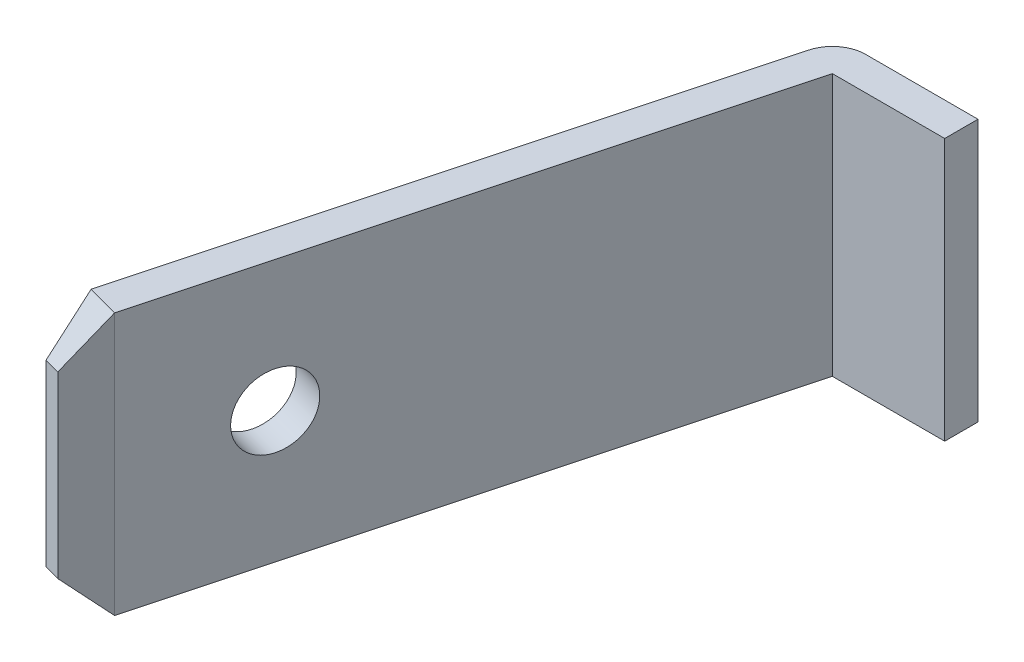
ISO-10303-21;
HEADER;
FILE_DESCRIPTION(('STEP AP214'),'2;1');
FILE_NAME('part.step','',(''),(''),'','','');
FILE_SCHEMA(('AUTOMOTIVE_DESIGN { 1 0 10303 214 1 1 1 1 }'));
ENDSEC;
DATA;
#1=APPLICATION_CONTEXT('core data for automotive mechanical design processes');
#2=APPLICATION_PROTOCOL_DEFINITION('international standard','automotive_design',2000,#1);
#3=PRODUCT_CONTEXT('',#1,'mechanical');
#4=PRODUCT('Part','Part','',(#3));
#5=PRODUCT_RELATED_PRODUCT_CATEGORY('part','',(#4));
#6=PRODUCT_DEFINITION_FORMATION('','',#4);
#7=PRODUCT_DEFINITION_CONTEXT('part definition',#1,'design');
#8=PRODUCT_DEFINITION('design','',#6,#7);
#9=PRODUCT_DEFINITION_SHAPE('','',#8);
#10=(LENGTH_UNIT() NAMED_UNIT(*) SI_UNIT(.MILLI.,.METRE.));
#11=(NAMED_UNIT(*) PLANE_ANGLE_UNIT() SI_UNIT($,.RADIAN.));
#12=(NAMED_UNIT(*) SI_UNIT($,.STERADIAN.) SOLID_ANGLE_UNIT());
#13=UNCERTAINTY_MEASURE_WITH_UNIT(LENGTH_MEASURE(1.E-05),#10,'distance_accuracy_value','');
#14=(GEOMETRIC_REPRESENTATION_CONTEXT(3) GLOBAL_UNCERTAINTY_ASSIGNED_CONTEXT((#13)) GLOBAL_UNIT_ASSIGNED_CONTEXT((#10,
#11,#12)) REPRESENTATION_CONTEXT('',''));
#15=CARTESIAN_POINT('',(0.,0.,0.));
#16=DIRECTION('',(0.,0.,1.));
#17=DIRECTION('',(1.,0.,0.));
#18=AXIS2_PLACEMENT_3D('',#15,#16,#17);
#19=CARTESIAN_POINT('',(-13.1,5.062,-14.));
#20=DIRECTION('',(1.,0.,0.));
#21=DIRECTION('',(0.,0.,-1.));
#22=AXIS2_PLACEMENT_3D('',#19,#20,#21);
#23=PLANE('',#22);
#24=DIRECTION('',(0.,1.,0.));
#25=VECTOR('',#24,1.);
#26=CARTESIAN_POINT('',(-13.1,5.062,-14.));
#27=LINE('',#26,#25);
#28=CARTESIAN_POINT('',(-13.1,1.912,-14.));
#29=VERTEX_POINT('',#28);
#30=CARTESIAN_POINT('',(-13.1,8.212,-14.));
#31=VERTEX_POINT('',#30);
#32=EDGE_CURVE('E129',#29,#31,#27,.T.);
#33=ORIENTED_EDGE('',*,*,#32,.F.);
#34=DIRECTION('',(0.,0.,-1.));
#35=VECTOR('',#34,1.);
#36=CARTESIAN_POINT('',(-13.1,1.912,-14.));
#37=LINE('',#36,#35);
#38=CARTESIAN_POINT('',(-13.1,1.912,-14.8));
#39=VERTEX_POINT('',#38);
#40=EDGE_CURVE('E166',#29,#39,#37,.T.);
#41=ORIENTED_EDGE('',*,*,#40,.T.);
#42=DIRECTION('',(0.,1.,0.));
#43=VECTOR('',#42,1.);
#44=CARTESIAN_POINT('',(-13.1,5.062,-14.8));
#45=LINE('',#44,#43);
#46=CARTESIAN_POINT('',(-13.1,8.212,-14.8));
#47=VERTEX_POINT('',#46);
#48=EDGE_CURVE('E127',#39,#47,#45,.T.);
#49=ORIENTED_EDGE('',*,*,#48,.T.);
#50=DIRECTION('',(0.,0.,-1.));
#51=VECTOR('',#50,1.);
#52=CARTESIAN_POINT('',(-13.1,8.212,-14.));
#53=LINE('',#52,#51);
#54=EDGE_CURVE('E92',#47,#31,#53,.F.);
#55=ORIENTED_EDGE('',*,*,#54,.T.);
#56=EDGE_LOOP('',(#33,#41,#49,#55));
#57=FACE_BOUND('',#56,.T.);
#58=ADVANCED_FACE('F18',(#57),#23,.T.);
#59=CARTESIAN_POINT('',(-19.8961763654,0.651999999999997,0.514397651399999));
#60=DIRECTION('',(-0.896409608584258,0.,-0.443226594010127));
#61=DIRECTION('',(-0.443226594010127,0.,0.896409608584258));
#62=AXIS2_PLACEMENT_3D('',#59,#60,#61);
#63=PLANE('',#62);
#64=DIRECTION('',(0.,1.,0.));
#65=VECTOR('',#64,1.);
#66=CARTESIAN_POINT('',(-19.4441721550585,5.062,-0.399764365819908));
#67=LINE('',#66,#65);
#68=CARTESIAN_POINT('',(-19.444172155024,1.91200000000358,-0.399764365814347));
#69=VERTEX_POINT('',#68);
#70=CARTESIAN_POINT('',(-19.4441721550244,8.21199999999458,-0.399764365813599));
#71=VERTEX_POINT('',#70);
#72=EDGE_CURVE('E126',#69,#71,#67,.T.);
#73=ORIENTED_EDGE('',*,*,#72,.T.);
#74=DIRECTION('',(0.316466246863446,0.700140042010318,-0.640041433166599));
#75=VECTOR('',#74,1.);
#76=CARTESIAN_POINT('',(-19.8961763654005,7.21200000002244,0.514397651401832));
#77=LINE('',#76,#75);
#78=CARTESIAN_POINT('',(-19.8961763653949,7.21200000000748,0.514397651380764));
#79=VERTEX_POINT('',#78);
#80=EDGE_CURVE('E162',#79,#71,#77,.T.);
#81=ORIENTED_EDGE('',*,*,#80,.F.);
#82=DIRECTION('',(0.,1.,0.));
#83=VECTOR('',#82,1.);
#84=CARTESIAN_POINT('',(-19.896176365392,5.062,0.514397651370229));
#85=LINE('',#84,#83);
#86=CARTESIAN_POINT('',(-19.8961763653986,2.91199999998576,0.514397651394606));
#87=VERTEX_POINT('',#86);
#88=EDGE_CURVE('E149',#79,#87,#85,.F.);
#89=ORIENTED_EDGE('',*,*,#88,.T.);
#90=DIRECTION('',(0.316466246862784,-0.700140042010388,-0.64004143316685));
#91=VECTOR('',#90,1.);
#92=CARTESIAN_POINT('',(-19.8961763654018,2.9119999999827,0.514397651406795));
#93=LINE('',#92,#91);
#94=EDGE_CURVE('E132',#87,#69,#93,.T.);
#95=ORIENTED_EDGE('',*,*,#94,.T.);
#96=EDGE_LOOP('',(#73,#81,#89,#95));
#97=FACE_BOUND('',#96,.T.);
#98=ADVANCED_FACE('F234',(#97),#63,.F.);
#99=CARTESIAN_POINT('',(-11.62485362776,8.212,1.6954157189));
#100=DIRECTION('',(-0.183012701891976,0.707106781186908,0.683012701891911));
#101=DIRECTION('',(0.,-0.69474659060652,0.719254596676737));
#102=AXIS2_PLACEMENT_3D('',#99,#100,#101);
#103=PLANE('',#102);
#104=DIRECTION('',(-0.965925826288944,0.,-0.258819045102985));
#105=VECTOR('',#104,1.);
#106=CARTESIAN_POINT('',(-19.7029912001,7.212,0.5661614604));
#107=LINE('',#106,#105);
#108=CARTESIAN_POINT('',(-20.2825466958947,7.212,0.410870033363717));
#109=VERTEX_POINT('',#108);
#110=EDGE_CURVE('E159',#109,#79,#107,.F.);
#111=ORIENTED_EDGE('',*,*,#110,.T.);
#112=ORIENTED_EDGE('',*,*,#80,.T.);
#113=DIRECTION('',(0.965925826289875,0.,0.258819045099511));
#114=VECTOR('',#113,1.);
#115=CARTESIAN_POINT('',(-20.2169128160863,8.212,-0.606819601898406));
#116=LINE('',#115,#114);
#117=CARTESIAN_POINT('',(-20.2169128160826,8.21200000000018,-0.606819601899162));
#118=VERTEX_POINT('',#117);
#119=EDGE_CURVE('E110',#118,#71,#116,.T.);
#120=ORIENTED_EDGE('',*,*,#119,.F.);
#121=DIRECTION('',(-0.0459529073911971,-0.700140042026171,0.71252526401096));
#122=VECTOR('',#121,1.);
#123=CARTESIAN_POINT('',(-20.2169128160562,8.21199999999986,-0.606819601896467));
#124=LINE('',#123,#122);
#125=EDGE_CURVE('E156',#118,#109,#124,.T.);
#126=ORIENTED_EDGE('',*,*,#125,.T.);
#127=EDGE_LOOP('',(#111,#112,#120,#126));
#128=FACE_BOUND('',#127,.T.);
#129=ADVANCED_FACE('F231',(#128),#103,.T.);
#130=CARTESIAN_POINT('',(-19.7029912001,5.062,0.5661614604));
#131=DIRECTION('',(0.258819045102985,0.,-0.965925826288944));
#132=DIRECTION('',(-0.965925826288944,0.,-0.258819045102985));
#133=AXIS2_PLACEMENT_3D('',#130,#131,#132);
#134=PLANE('',#133);
#135=ORIENTED_EDGE('',*,*,#88,.F.);
#136=ORIENTED_EDGE('',*,*,#110,.F.);
#137=DIRECTION('',(0.,1.,0.));
#138=VECTOR('',#137,1.);
#139=CARTESIAN_POINT('',(-20.2825466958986,9.472,0.410870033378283));
#140=LINE('',#139,#138);
#141=CARTESIAN_POINT('',(-20.2825466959,2.91199999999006,0.41087003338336));
#142=VERTEX_POINT('',#141);
#143=EDGE_CURVE('E152',#109,#142,#140,.F.);
#144=ORIENTED_EDGE('',*,*,#143,.T.);
#145=DIRECTION('',(0.965925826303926,-5.71873277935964E-11,0.25881904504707));
#146=VECTOR('',#145,1.);
#147=CARTESIAN_POINT('',(-20.2825466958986,2.91200000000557,0.410870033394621));
#148=LINE('',#147,#146);
#149=EDGE_CURVE('E135',#142,#87,#148,.T.);
#150=ORIENTED_EDGE('',*,*,#149,.T.);
#151=EDGE_LOOP('',(#135,#136,#144,#150));
#152=FACE_BOUND('',#151,.T.);
#153=ADVANCED_FACE('F238',(#152),#134,.F.);
#154=CARTESIAN_POINT('',(-11.62485362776,1.912,1.6954157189));
#155=DIRECTION('',(0.183012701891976,0.707106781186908,-0.683012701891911));
#156=DIRECTION('',(0.,0.69474659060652,0.719254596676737));
#157=AXIS2_PLACEMENT_3D('',#154,#155,#156);
#158=PLANE('',#157);
#159=ORIENTED_EDGE('',*,*,#94,.F.);
#160=ORIENTED_EDGE('',*,*,#149,.F.);
#161=DIRECTION('',(0.0459529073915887,-0.700140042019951,-0.712525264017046));
#162=VECTOR('',#161,1.);
#163=CARTESIAN_POINT('',(-20.2825466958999,2.91200000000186,0.410870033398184));
#164=LINE('',#163,#162);
#165=CARTESIAN_POINT('',(-20.2169128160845,1.912,-0.606819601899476));
#166=VERTEX_POINT('',#165);
#167=EDGE_CURVE('E155',#142,#166,#164,.T.);
#168=ORIENTED_EDGE('',*,*,#167,.T.);
#169=DIRECTION('',(0.96592582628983,0.,0.258819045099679));
#170=VECTOR('',#169,1.);
#171=CARTESIAN_POINT('',(-20.2169128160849,1.912,-0.606819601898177));
#172=LINE('',#171,#170);
#173=EDGE_CURVE('E36',#166,#69,#172,.T.);
#174=ORIENTED_EDGE('',*,*,#173,.T.);
#175=EDGE_LOOP('',(#159,#160,#168,#174));
#176=FACE_BOUND('',#175,.T.);
#177=ADVANCED_FACE('F239',(#176),#158,.F.);
#178=CARTESIAN_POINT('',(-15.8,5.062,-14.));
#179=DIRECTION('',(0.,0.,1.));
#180=DIRECTION('',(1.,0.,0.));
#181=AXIS2_PLACEMENT_3D('',#178,#179,#180);
#182=PLANE('',#181);
#183=DIRECTION('',(0.,1.,0.));
#184=VECTOR('',#183,1.);
#185=CARTESIAN_POINT('',(-15.8,5.062,-14.));
#186=LINE('',#185,#184);
#187=CARTESIAN_POINT('',(-15.8,8.21199999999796,-14.));
#188=VERTEX_POINT('',#187);
#189=CARTESIAN_POINT('',(-15.8,1.912,-14.));
#190=VERTEX_POINT('',#189);
#191=EDGE_CURVE('E105',#188,#190,#186,.F.);
#192=ORIENTED_EDGE('',*,*,#191,.T.);
#193=DIRECTION('',(1.,0.,0.));
#194=VECTOR('',#193,1.);
#195=CARTESIAN_POINT('',(-3.725,1.912,-14.));
#196=LINE('',#195,#194);
#197=EDGE_CURVE('E141',#190,#29,#196,.T.);
#198=ORIENTED_EDGE('',*,*,#197,.T.);
#199=ORIENTED_EDGE('',*,*,#32,.T.);
#200=DIRECTION('',(1.,0.,0.));
#201=VECTOR('',#200,1.);
#202=CARTESIAN_POINT('',(-3.725,8.212,-14.));
#203=LINE('',#202,#201);
#204=EDGE_CURVE('E117',#188,#31,#203,.T.);
#205=ORIENTED_EDGE('',*,*,#204,.F.);
#206=EDGE_LOOP('',(#192,#198,#199,#205));
#207=FACE_BOUND('',#206,.T.);
#208=ADVANCED_FACE('F246',(#207),#182,.T.);
#209=CARTESIAN_POINT('',(-16.4138615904,5.062,-14.8));
#210=DIRECTION('',(0.,0.,1.));
#211=DIRECTION('',(1.,0.,0.));
#212=AXIS2_PLACEMENT_3D('',#209,#210,#211);
#213=PLANE('',#212);
#214=ORIENTED_EDGE('',*,*,#48,.F.);
#215=DIRECTION('',(1.,0.,0.));
#216=VECTOR('',#215,1.);
#217=CARTESIAN_POINT('',(-3.725,1.912,-14.8));
#218=LINE('',#217,#216);
#219=CARTESIAN_POINT('',(-15.8,1.912,-14.8));
#220=VERTEX_POINT('',#219);
#221=EDGE_CURVE('E101',#39,#220,#218,.F.);
#222=ORIENTED_EDGE('',*,*,#221,.T.);
#223=DIRECTION('',(0.,-1.,0.));
#224=VECTOR('',#223,1.);
#225=CARTESIAN_POINT('',(-15.8,5.062,-14.8));
#226=LINE('',#225,#224);
#227=CARTESIAN_POINT('',(-15.8,8.212,-14.8));
#228=VERTEX_POINT('',#227);
#229=EDGE_CURVE('E96',#228,#220,#226,.T.);
#230=ORIENTED_EDGE('',*,*,#229,.F.);
#231=DIRECTION('',(1.,0.,0.));
#232=VECTOR('',#231,1.);
#233=CARTESIAN_POINT('',(-3.725,8.212,-14.8));
#234=LINE('',#233,#232);
#235=EDGE_CURVE('E85',#47,#228,#234,.F.);
#236=ORIENTED_EDGE('',*,*,#235,.F.);
#237=EDGE_LOOP('',(#214,#222,#230,#236));
#238=FACE_BOUND('',#237,.T.);
#239=ADVANCED_FACE('F99',(#238),#213,.F.);
#240=CARTESIAN_POINT('',(-15.8,5.062,-14.));
#241=DIRECTION('',(-0.965925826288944,0.,-0.258819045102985));
#242=DIRECTION('',(-0.258819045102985,0.,0.965925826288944));
#243=AXIS2_PLACEMENT_3D('',#240,#241,#242);
#244=PLANE('',#243);
#245=CARTESIAN_POINT('',(-18.628892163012,5.062,-3.44243071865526));
#246=DIRECTION('',(-0.965925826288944,0.,-0.258819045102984));
#247=DIRECTION('',(-0.258819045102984,0.,0.965925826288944));
#248=AXIS2_PLACEMENT_3D('',#245,#246,#247);
#249=CIRCLE('',#248,0.875);
#250=CARTESIAN_POINT('',(-18.8553588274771,5.062,-2.59724562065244));
#251=VERTEX_POINT('',#250);
#252=EDGE_CURVE('E191',#251,#251,#249,.T.);
#253=ORIENTED_EDGE('',*,*,#252,.T.);
#254=EDGE_LOOP('',(#253));
#255=FACE_BOUND('',#254,.T.);
#256=ORIENTED_EDGE('',*,*,#191,.F.);
#257=DIRECTION('',(0.258819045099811,0.,-0.965925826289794));
#258=VECTOR('',#257,1.);
#259=CARTESIAN_POINT('',(-19.4441721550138,8.212,-0.399764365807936));
#260=LINE('',#259,#258);
#261=EDGE_CURVE('E112',#71,#188,#260,.T.);
#262=ORIENTED_EDGE('',*,*,#261,.F.);
#263=ORIENTED_EDGE('',*,*,#72,.F.);
#264=DIRECTION('',(0.258819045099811,0.,-0.965925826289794));
#265=VECTOR('',#264,1.);
#266=CARTESIAN_POINT('',(-19.4441721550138,1.912,-0.399764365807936));
#267=LINE('',#266,#265);
#268=EDGE_CURVE('E138',#69,#190,#267,.T.);
#269=ORIENTED_EDGE('',*,*,#268,.T.);
#270=EDGE_LOOP('',(#256,#262,#263,#269));
#271=FACE_BOUND('',#270,.T.);
#272=ADVANCED_FACE('F243',(#255,#271),#244,.F.);
#273=CARTESIAN_POINT('',(-15.8,5.062,-14.));
#274=DIRECTION('',(0.,-1.,0.));
#275=DIRECTION('',(0.,0.,-1.));
#276=AXIS2_PLACEMENT_3D('',#273,#274,#275);
#277=CYLINDRICAL_SURFACE('',#276,0.8);
#278=CARTESIAN_POINT('',(-15.8,8.212,-14.));
#279=DIRECTION('',(0.,-1.,0.));
#280=DIRECTION('',(0.,0.,-1.));
#281=AXIS2_PLACEMENT_3D('',#278,#279,#280);
#282=CIRCLE('',#281,0.8);
#283=CARTESIAN_POINT('',(-16.5727406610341,8.212,-14.2070552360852));
#284=VERTEX_POINT('',#283);
#285=EDGE_CURVE('E21',#228,#284,#282,.F.);
#286=ORIENTED_EDGE('',*,*,#285,.F.);
#287=ORIENTED_EDGE('',*,*,#229,.T.);
#288=CARTESIAN_POINT('',(-15.8,1.912,-14.));
#289=DIRECTION('',(0.,-1.,0.));
#290=DIRECTION('',(0.,0.,-1.));
#291=AXIS2_PLACEMENT_3D('',#288,#289,#290);
#292=CIRCLE('',#291,0.8);
#293=CARTESIAN_POINT('',(-16.5727406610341,1.912,-14.2070552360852));
#294=VERTEX_POINT('',#293);
#295=EDGE_CURVE('E193',#220,#294,#292,.F.);
#296=ORIENTED_EDGE('',*,*,#295,.T.);
#297=DIRECTION('',(0.,1.,0.));
#298=VECTOR('',#297,1.);
#299=CARTESIAN_POINT('',(-16.5727406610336,5.062,-14.207055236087));
#300=LINE('',#299,#298);
#301=EDGE_CURVE('E109',#294,#284,#300,.T.);
#302=ORIENTED_EDGE('',*,*,#301,.T.);
#303=EDGE_LOOP('',(#286,#287,#296,#302));
#304=FACE_BOUND('',#303,.T.);
#305=ADVANCED_FACE('F108',(#304),#277,.T.);
#306=CARTESIAN_POINT('',(-3.725,8.212,-14.8));
#307=DIRECTION('',(0.,1.,0.));
#308=DIRECTION('',(0.,0.,1.));
#309=AXIS2_PLACEMENT_3D('',#306,#307,#308);
#310=PLANE('',#309);
#311=ORIENTED_EDGE('',*,*,#204,.T.);
#312=ORIENTED_EDGE('',*,*,#54,.F.);
#313=ORIENTED_EDGE('',*,*,#235,.T.);
#314=ORIENTED_EDGE('',*,*,#285,.T.);
#315=DIRECTION('',(0.258819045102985,0.,-0.965925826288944));
#316=VECTOR('',#315,1.);
#317=CARTESIAN_POINT('',(-20.4757318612,8.212,0.3591062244));
#318=LINE('',#317,#316);
#319=EDGE_CURVE('E209',#284,#118,#318,.F.);
#320=ORIENTED_EDGE('',*,*,#319,.T.);
#321=ORIENTED_EDGE('',*,*,#119,.T.);
#322=ORIENTED_EDGE('',*,*,#261,.T.);
#323=EDGE_LOOP('',(#311,#312,#313,#314,#320,#321,#322));
#324=FACE_BOUND('',#323,.T.);
#325=ADVANCED_FACE('F88',(#324),#310,.T.);
#326=CARTESIAN_POINT('',(-20.2825466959,9.472,0.4108700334));
#327=DIRECTION('',(0.997926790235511,0.,0.0643593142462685));
#328=DIRECTION('',(0.0643593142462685,0.,-0.997926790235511));
#329=AXIS2_PLACEMENT_3D('',#326,#327,#328);
#330=PLANE('',#329);
#331=ORIENTED_EDGE('',*,*,#143,.F.);
#332=ORIENTED_EDGE('',*,*,#125,.F.);
#333=DIRECTION('',(0.,1.,0.));
#334=VECTOR('',#333,1.);
#335=CARTESIAN_POINT('',(-20.2169128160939,5.062,-0.606819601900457));
#336=LINE('',#335,#334);
#337=EDGE_CURVE('E211',#118,#166,#336,.F.);
#338=ORIENTED_EDGE('',*,*,#337,.T.);
#339=ORIENTED_EDGE('',*,*,#167,.F.);
#340=EDGE_LOOP('',(#331,#332,#338,#339));
#341=FACE_BOUND('',#340,.T.);
#342=ADVANCED_FACE('F229',(#341),#330,.F.);
#343=CARTESIAN_POINT('',(-3.725,1.912,-14.8));
#344=DIRECTION('',(0.,1.,0.));
#345=DIRECTION('',(0.,0.,1.));
#346=AXIS2_PLACEMENT_3D('',#343,#344,#345);
#347=PLANE('',#346);
#348=ORIENTED_EDGE('',*,*,#40,.F.);
#349=ORIENTED_EDGE('',*,*,#197,.F.);
#350=ORIENTED_EDGE('',*,*,#268,.F.);
#351=ORIENTED_EDGE('',*,*,#173,.F.);
#352=DIRECTION('',(0.258819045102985,0.,-0.965925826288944));
#353=VECTOR('',#352,1.);
#354=CARTESIAN_POINT('',(-20.4757318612,1.912,0.3591062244));
#355=LINE('',#354,#353);
#356=EDGE_CURVE('E27',#166,#294,#355,.T.);
#357=ORIENTED_EDGE('',*,*,#356,.T.);
#358=ORIENTED_EDGE('',*,*,#295,.F.);
#359=ORIENTED_EDGE('',*,*,#221,.F.);
#360=EDGE_LOOP('',(#348,#349,#350,#351,#357,#358,#359));
#361=FACE_BOUND('',#360,.T.);
#362=ADVANCED_FACE('F223',(#361),#347,.F.);
#363=CARTESIAN_POINT('',(-14.8072074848,5.062,-2.4184133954));
#364=DIRECTION('',(-0.965925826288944,0.,-0.258819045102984));
#365=DIRECTION('',(-0.258819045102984,0.,0.965925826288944));
#366=AXIS2_PLACEMENT_3D('',#363,#364,#365);
#367=CYLINDRICAL_SURFACE('',#366,0.875);
#368=ORIENTED_EDGE('',*,*,#252,.F.);
#369=EDGE_LOOP('',(#368));
#370=FACE_BOUND('',#369,.T.);
#371=CARTESIAN_POINT('',(-19.4016328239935,5.062,-3.64948595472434));
#372=DIRECTION('',(-0.965925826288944,0.,-0.258819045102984));
#373=DIRECTION('',(-0.258819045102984,0.,0.965925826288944));
#374=AXIS2_PLACEMENT_3D('',#371,#372,#373);
#375=CIRCLE('',#374,0.875);
#376=CARTESIAN_POINT('',(-19.6280994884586,5.062,-2.80430085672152));
#377=VERTEX_POINT('',#376);
#378=EDGE_CURVE('E11',#377,#377,#375,.T.);
#379=ORIENTED_EDGE('',*,*,#378,.T.);
#380=EDGE_LOOP('',(#379));
#381=FACE_BOUND('',#380,.T.);
#382=ADVANCED_FACE('F255',(#370,#381),#367,.F.);
#383=CARTESIAN_POINT('',(-20.4757318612,5.062,0.3591062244));
#384=DIRECTION('',(0.965925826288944,0.,0.258819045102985));
#385=DIRECTION('',(0.258819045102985,0.,-0.965925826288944));
#386=AXIS2_PLACEMENT_3D('',#383,#384,#385);
#387=PLANE('',#386);
#388=ORIENTED_EDGE('',*,*,#378,.F.);
#389=EDGE_LOOP('',(#388));
#390=FACE_BOUND('',#389,.T.);
#391=ORIENTED_EDGE('',*,*,#337,.F.);
#392=ORIENTED_EDGE('',*,*,#319,.F.);
#393=ORIENTED_EDGE('',*,*,#301,.F.);
#394=ORIENTED_EDGE('',*,*,#356,.F.);
#395=EDGE_LOOP('',(#391,#392,#393,#394));
#396=FACE_BOUND('',#395,.T.);
#397=ADVANCED_FACE('F226',(#390,#396),#387,.F.);
#398=CLOSED_SHELL('',(#58,#98,#129,#153,#177,#208,#239,#272,#305,#325,#342,#362,#382,#397));
#399=MANIFOLD_SOLID_BREP('B1',#398);
#400=ADVANCED_BREP_SHAPE_REPRESENTATION('',(#18,#399),#14);
#401=SHAPE_DEFINITION_REPRESENTATION(#9,#400);
ENDSEC;
END-ISO-10303-21;
